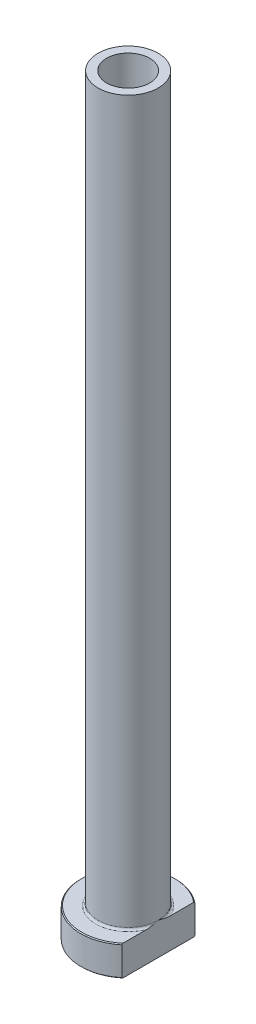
ISO-10303-21;
HEADER;
FILE_DESCRIPTION(('STEP AP214'),'2;1');
FILE_NAME('part.step','',(''),(''),'','','');
FILE_SCHEMA(('AUTOMOTIVE_DESIGN { 1 0 10303 214 1 1 1 1 }'));
ENDSEC;
DATA;
#1=APPLICATION_CONTEXT('core data for automotive mechanical design processes');
#2=APPLICATION_PROTOCOL_DEFINITION('international standard','automotive_design',2000,#1);
#3=PRODUCT_CONTEXT('',#1,'mechanical');
#4=PRODUCT('Part','Part','',(#3));
#5=PRODUCT_RELATED_PRODUCT_CATEGORY('part','',(#4));
#6=PRODUCT_DEFINITION_FORMATION('','',#4);
#7=PRODUCT_DEFINITION_CONTEXT('part definition',#1,'design');
#8=PRODUCT_DEFINITION('design','',#6,#7);
#9=PRODUCT_DEFINITION_SHAPE('','',#8);
#10=(LENGTH_UNIT() NAMED_UNIT(*) SI_UNIT(.MILLI.,.METRE.));
#11=(NAMED_UNIT(*) PLANE_ANGLE_UNIT() SI_UNIT($,.RADIAN.));
#12=(NAMED_UNIT(*) SI_UNIT($,.STERADIAN.) SOLID_ANGLE_UNIT());
#13=UNCERTAINTY_MEASURE_WITH_UNIT(LENGTH_MEASURE(1.E-05),#10,'distance_accuracy_value','');
#14=(GEOMETRIC_REPRESENTATION_CONTEXT(3) GLOBAL_UNCERTAINTY_ASSIGNED_CONTEXT((#13)) GLOBAL_UNIT_ASSIGNED_CONTEXT((#10,
#11,#12)) REPRESENTATION_CONTEXT('',''));
#15=CARTESIAN_POINT('',(0.,0.,0.));
#16=DIRECTION('',(0.,0.,1.));
#17=DIRECTION('',(1.,0.,0.));
#18=AXIS2_PLACEMENT_3D('',#15,#16,#17);
#19=CARTESIAN_POINT('',(0.,92.1876809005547,0.));
#20=DIRECTION('',(0.,1.,0.));
#21=DIRECTION('',(0.,0.,1.));
#22=AXIS2_PLACEMENT_3D('',#19,#20,#21);
#23=CYLINDRICAL_SURFACE('',#22,5.);
#24=CARTESIAN_POINT('',(0.,175.,0.));
#25=DIRECTION('',(0.,1.,0.));
#26=DIRECTION('',(0.,0.,1.));
#27=AXIS2_PLACEMENT_3D('',#24,#25,#26);
#28=CIRCLE('',#27,5.);
#29=CARTESIAN_POINT('',(0.,175.,5.));
#30=VERTEX_POINT('',#29);
#31=EDGE_CURVE('E167',#30,#30,#28,.T.);
#32=ORIENTED_EDGE('',*,*,#31,.T.);
#33=EDGE_LOOP('',(#32));
#34=FACE_BOUND('',#33,.T.);
#35=CARTESIAN_POINT('',(0.,130.,0.));
#36=DIRECTION('',(0.,1.,0.));
#37=DIRECTION('',(0.,0.,1.));
#38=AXIS2_PLACEMENT_3D('',#35,#36,#37);
#39=CIRCLE('',#38,5.);
#40=CARTESIAN_POINT('',(0.,130.,5.));
#41=VERTEX_POINT('',#40);
#42=EDGE_CURVE('E170',#41,#41,#39,.T.);
#43=ORIENTED_EDGE('',*,*,#42,.F.);
#44=EDGE_LOOP('',(#43));
#45=FACE_BOUND('',#44,.T.);
#46=ADVANCED_FACE('F32',(#34,#45),#23,.F.);
#47=CARTESIAN_POINT('',(-5.,175.,0.));
#48=DIRECTION('',(0.,1.,0.));
#49=DIRECTION('',(0.,0.,1.));
#50=AXIS2_PLACEMENT_3D('',#47,#48,#49);
#51=PLANE('',#50);
#52=CARTESIAN_POINT('',(0.,175.,0.));
#53=DIRECTION('',(0.,1.,0.));
#54=DIRECTION('',(0.,0.,1.));
#55=AXIS2_PLACEMENT_3D('',#52,#53,#54);
#56=CIRCLE('',#55,7.00000000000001);
#57=CARTESIAN_POINT('',(0.,175.,7.00000000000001));
#58=VERTEX_POINT('',#57);
#59=EDGE_CURVE('E174',#58,#58,#56,.T.);
#60=ORIENTED_EDGE('',*,*,#59,.T.);
#61=EDGE_LOOP('',(#60));
#62=FACE_BOUND('',#61,.T.);
#63=ORIENTED_EDGE('',*,*,#31,.F.);
#64=EDGE_LOOP('',(#63));
#65=FACE_BOUND('',#64,.T.);
#66=ADVANCED_FACE('F157',(#62,#65),#51,.T.);
#67=CARTESIAN_POINT('',(0.,92.1876809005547,0.));
#68=DIRECTION('',(0.,1.,0.));
#69=DIRECTION('',(0.,0.,1.));
#70=AXIS2_PLACEMENT_3D('',#67,#68,#69);
#71=CYLINDRICAL_SURFACE('',#70,7.);
#72=CARTESIAN_POINT('',(0.,7.50000000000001,0.));
#73=DIRECTION('',(0.,1.,0.));
#74=DIRECTION('',(0.,0.,1.));
#75=AXIS2_PLACEMENT_3D('',#72,#73,#74);
#76=CIRCLE('',#75,7.);
#77=CARTESIAN_POINT('',(7.,7.50000000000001,0.));
#78=VERTEX_POINT('',#77);
#79=EDGE_CURVE('E180',#78,#78,#76,.T.);
#80=ORIENTED_EDGE('',*,*,#79,.T.);
#81=EDGE_LOOP('',(#80));
#82=FACE_BOUND('',#81,.T.);
#83=ORIENTED_EDGE('',*,*,#59,.F.);
#84=EDGE_LOOP('',(#83));
#85=FACE_BOUND('',#84,.T.);
#86=ADVANCED_FACE('F162',(#82,#85),#71,.T.);
#87=CARTESIAN_POINT('',(-6.99999999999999,7.,0.));
#88=DIRECTION('',(0.,1.,0.));
#89=DIRECTION('',(0.,0.,1.));
#90=AXIS2_PLACEMENT_3D('',#87,#88,#89);
#91=PLANE('',#90);
#92=DIRECTION('',(0.,0.,1.));
#93=VECTOR('',#92,1.);
#94=CARTESIAN_POINT('',(6.99999999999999,7.,0.));
#95=LINE('',#94,#93);
#96=CARTESIAN_POINT('',(7.,7.,-8.22435407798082));
#97=VERTEX_POINT('',#96);
#98=CARTESIAN_POINT('',(6.99999999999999,7.,-2.69258240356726));
#99=VERTEX_POINT('',#98);
#100=EDGE_CURVE('E54',#97,#99,#95,.T.);
#101=ORIENTED_EDGE('',*,*,#100,.F.);
#102=CARTESIAN_POINT('',(0.,7.,0.));
#103=DIRECTION('',(0.,1.,0.));
#104=DIRECTION('',(0.,0.,1.));
#105=AXIS2_PLACEMENT_3D('',#102,#103,#104);
#106=CIRCLE('',#105,10.8);
#107=CARTESIAN_POINT('',(6.99999999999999,7.,8.22435407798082));
#108=VERTEX_POINT('',#107);
#109=EDGE_CURVE('E186',#97,#108,#106,.T.);
#110=ORIENTED_EDGE('',*,*,#109,.T.);
#111=CARTESIAN_POINT('',(6.99999999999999,7.,2.69258240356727));
#112=VERTEX_POINT('',#111);
#113=EDGE_CURVE('E134',#112,#108,#95,.T.);
#114=ORIENTED_EDGE('',*,*,#113,.F.);
#115=CARTESIAN_POINT('',(0.,7.,0.));
#116=DIRECTION('',(0.,1.,0.));
#117=DIRECTION('',(0.,0.,1.));
#118=AXIS2_PLACEMENT_3D('',#115,#116,#117);
#119=CIRCLE('',#118,7.5);
#120=EDGE_CURVE('E183',#112,#99,#119,.F.);
#121=ORIENTED_EDGE('',*,*,#120,.T.);
#122=EDGE_LOOP('',(#101,#110,#114,#121));
#123=FACE_BOUND('',#122,.T.);
#124=ADVANCED_FACE('F197',(#123),#91,.T.);
#125=CARTESIAN_POINT('',(0.,92.1876809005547,0.));
#126=DIRECTION('',(0.,1.,0.));
#127=DIRECTION('',(0.,0.,1.));
#128=AXIS2_PLACEMENT_3D('',#125,#126,#127);
#129=CYLINDRICAL_SURFACE('',#128,11.);
#130=DIRECTION('',(0.,-1.,0.));
#131=VECTOR('',#130,1.);
#132=CARTESIAN_POINT('',(6.99999999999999,175.,8.48528137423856));
#133=LINE('',#132,#131);
#134=CARTESIAN_POINT('',(6.99999999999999,6.8,8.48528137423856));
#135=VERTEX_POINT('',#134);
#136=CARTESIAN_POINT('',(6.99999999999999,0.199999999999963,8.48528137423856));
#137=VERTEX_POINT('',#136);
#138=EDGE_CURVE('E82',#135,#137,#133,.T.);
#139=ORIENTED_EDGE('',*,*,#138,.F.);
#140=CARTESIAN_POINT('',(0.,6.8,0.));
#141=DIRECTION('',(0.,1.,0.));
#142=DIRECTION('',(0.,0.,1.));
#143=AXIS2_PLACEMENT_3D('',#140,#141,#142);
#144=CIRCLE('',#143,11.);
#145=CARTESIAN_POINT('',(7.,6.8,-8.48528137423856));
#146=VERTEX_POINT('',#145);
#147=EDGE_CURVE('E95',#135,#146,#144,.F.);
#148=ORIENTED_EDGE('',*,*,#147,.T.);
#149=DIRECTION('',(0.,-1.,0.));
#150=VECTOR('',#149,1.);
#151=CARTESIAN_POINT('',(7.,175.,-8.48528137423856));
#152=LINE('',#151,#150);
#153=CARTESIAN_POINT('',(7.,0.199999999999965,-8.48528137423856));
#154=VERTEX_POINT('',#153);
#155=EDGE_CURVE('E192',#146,#154,#152,.T.);
#156=ORIENTED_EDGE('',*,*,#155,.T.);
#157=CARTESIAN_POINT('',(0.,0.199999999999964,0.));
#158=DIRECTION('',(0.,-1.,0.));
#159=DIRECTION('',(0.,0.,-1.));
#160=AXIS2_PLACEMENT_3D('',#157,#158,#159);
#161=CIRCLE('',#160,11.);
#162=EDGE_CURVE('E98',#154,#137,#161,.F.);
#163=ORIENTED_EDGE('',*,*,#162,.T.);
#164=EDGE_LOOP('',(#139,#148,#156,#163));
#165=FACE_BOUND('',#164,.T.);
#166=ADVANCED_FACE('F190',(#165),#129,.T.);
#167=CARTESIAN_POINT('',(-11.,0.,0.));
#168=DIRECTION('',(0.,-1.,0.));
#169=DIRECTION('',(0.,0.,-1.));
#170=AXIS2_PLACEMENT_3D('',#167,#168,#169);
#171=PLANE('',#170);
#172=CARTESIAN_POINT('',(0.,0.,0.));
#173=DIRECTION('',(0.,-1.,0.));
#174=DIRECTION('',(0.,0.,-1.));
#175=AXIS2_PLACEMENT_3D('',#172,#173,#174);
#176=CIRCLE('',#175,5.74999999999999);
#177=CARTESIAN_POINT('',(0.,0.,-5.74999999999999));
#178=VERTEX_POINT('',#177);
#179=EDGE_CURVE('E40',#178,#178,#176,.F.);
#180=ORIENTED_EDGE('',*,*,#179,.T.);
#181=EDGE_LOOP('',(#180));
#182=FACE_BOUND('',#181,.T.);
#183=DIRECTION('',(0.,0.,-1.));
#184=VECTOR('',#183,1.);
#185=CARTESIAN_POINT('',(6.99999999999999,0.,8.48528137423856));
#186=LINE('',#185,#184);
#187=CARTESIAN_POINT('',(6.99999999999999,0.,8.22435407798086));
#188=VERTEX_POINT('',#187);
#189=CARTESIAN_POINT('',(7.,0.,-8.22435407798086));
#190=VERTEX_POINT('',#189);
#191=EDGE_CURVE('E47',#188,#190,#186,.T.);
#192=ORIENTED_EDGE('',*,*,#191,.F.);
#193=CARTESIAN_POINT('',(0.,0.,0.));
#194=DIRECTION('',(0.,-1.,0.));
#195=DIRECTION('',(0.,0.,-1.));
#196=AXIS2_PLACEMENT_3D('',#193,#194,#195);
#197=CIRCLE('',#196,10.8);
#198=EDGE_CURVE('E92',#188,#190,#197,.T.);
#199=ORIENTED_EDGE('',*,*,#198,.T.);
#200=EDGE_LOOP('',(#192,#199));
#201=FACE_BOUND('',#200,.T.);
#202=ADVANCED_FACE('F91',(#182,#201),#171,.T.);
#203=CARTESIAN_POINT('',(0.,92.1876809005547,0.));
#204=DIRECTION('',(0.,1.,0.));
#205=DIRECTION('',(0.,0.,1.));
#206=AXIS2_PLACEMENT_3D('',#203,#204,#205);
#207=CYLINDRICAL_SURFACE('',#206,5.25);
#208=CARTESIAN_POINT('',(0.,0.499999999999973,0.));
#209=DIRECTION('',(0.,-1.,0.));
#210=DIRECTION('',(0.,0.,-1.));
#211=AXIS2_PLACEMENT_3D('',#208,#209,#210);
#212=CIRCLE('',#211,5.25);
#213=CARTESIAN_POINT('',(0.,0.499999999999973,-5.25));
#214=VERTEX_POINT('',#213);
#215=EDGE_CURVE('E11',#214,#214,#212,.T.);
#216=ORIENTED_EDGE('',*,*,#215,.T.);
#217=EDGE_LOOP('',(#216));
#218=FACE_BOUND('',#217,.T.);
#219=CARTESIAN_POINT('',(0.,118.,0.));
#220=DIRECTION('',(0.,1.,0.));
#221=DIRECTION('',(0.,0.,1.));
#222=AXIS2_PLACEMENT_3D('',#219,#220,#221);
#223=CIRCLE('',#222,5.25000000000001);
#224=CARTESIAN_POINT('',(0.,118.,5.25000000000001));
#225=VERTEX_POINT('',#224);
#226=EDGE_CURVE('E172',#225,#225,#223,.T.);
#227=ORIENTED_EDGE('',*,*,#226,.T.);
#228=EDGE_LOOP('',(#227));
#229=FACE_BOUND('',#228,.T.);
#230=ADVANCED_FACE('F215',(#218,#229),#207,.F.);
#231=CARTESIAN_POINT('',(0.,118.,0.));
#232=DIRECTION('',(0.,-1.,0.));
#233=DIRECTION('',(0.,0.,-1.));
#234=AXIS2_PLACEMENT_3D('',#231,#232,#233);
#235=CONICAL_SURFACE('',#234,5.25000000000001,0.0208303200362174);
#236=ORIENTED_EDGE('',*,*,#42,.T.);
#237=EDGE_LOOP('',(#236));
#238=FACE_BOUND('',#237,.T.);
#239=ORIENTED_EDGE('',*,*,#226,.F.);
#240=EDGE_LOOP('',(#239));
#241=FACE_BOUND('',#240,.T.);
#242=ADVANCED_FACE('F111',(#238,#241),#235,.F.);
#243=CARTESIAN_POINT('',(0.,7.50000000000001,0.));
#244=DIRECTION('',(0.,1.,0.));
#245=DIRECTION('',(0.,0.,1.));
#246=AXIS2_PLACEMENT_3D('',#243,#244,#245);
#247=TOROIDAL_SURFACE('',#246,7.5,0.5);
#248=ORIENTED_EDGE('',*,*,#120,.F.);
#249=CARTESIAN_POINT('',(7.,7.50000000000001,0.));
#250=CARTESIAN_POINT('',(7.,7.50000080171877,-1.25568479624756E-10));
#251=CARTESIAN_POINT('',(7.,7.50000160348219,2.9022028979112E-07));
#252=CARTESIAN_POINT('',(7.,7.50000310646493,1.10846445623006E-06));
#253=CARTESIAN_POINT('',(7.,7.50000379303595,1.65470117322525E-06));
#254=CARTESIAN_POINT('',(7.,7.50000521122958,2.96102760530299E-06));
#255=CARTESIAN_POINT('',(7.,7.50000592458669,3.74204187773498E-06));
#256=CARTESIAN_POINT('',(7.,7.50000721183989,5.36891885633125E-06));
#257=CARTESIAN_POINT('',(7.,7.50000778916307,6.21226355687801E-06));
#258=CARTESIAN_POINT('',(7.,7.50000990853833,9.44889721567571E-06));
#259=CARTESIAN_POINT('',(7.,7.50001133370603,1.19224915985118E-05));
#260=CARTESIAN_POINT('',(7.,7.50001370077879,1.68453050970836E-05));
#261=CARTESIAN_POINT('',(7.,7.50001467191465,1.92810864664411E-05));
#262=CARTESIAN_POINT('',(7.,7.5000187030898,2.95057529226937E-05));
#263=CARTESIAN_POINT('',(7.,7.50002167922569,3.73333827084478E-05));
#264=CARTESIAN_POINT('',(7.,7.5000261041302,5.21820419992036E-05));
#265=CARTESIAN_POINT('',(7.,7.50002771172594,5.91556020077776E-05));
#266=CARTESIAN_POINT('',(7.,7.50003935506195,0.000110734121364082));
#267=CARTESIAN_POINT('',(7.,7.50004810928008,0.000155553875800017));
#268=CARTESIAN_POINT('',(6.99999999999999,7.50008643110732,0.00033254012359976));
#269=CARTESIAN_POINT('',(6.99999999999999,7.50012307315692,0.000463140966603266));
#270=CARTESIAN_POINT('',(7.,7.50026565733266,0.000980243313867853));
#271=CARTESIAN_POINT('',(7.,7.50036696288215,0.00136762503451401));
#272=CARTESIAN_POINT('',(6.99999999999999,7.50077257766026,0.00290683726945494));
#273=CARTESIAN_POINT('',(6.99999999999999,7.5010826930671,0.00405753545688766));
#274=CARTESIAN_POINT('',(7.,7.50237341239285,0.00885983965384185));
#275=CARTESIAN_POINT('',(7.,7.50334676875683,0.0125128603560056));
#276=CARTESIAN_POINT('',(6.99999999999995,7.51627189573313,0.0610038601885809));
#277=CARTESIAN_POINT('',(6.99999999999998,7.52827280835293,0.105832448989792));
#278=CARTESIAN_POINT('',(7.00000000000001,7.551709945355,0.193693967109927));
#279=CARTESIAN_POINT('',(7.,7.56314936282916,0.236726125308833));
#280=CARTESIAN_POINT('',(6.99999999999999,7.58740418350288,0.328321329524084));
#281=CARTESIAN_POINT('',(6.99999999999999,7.60020832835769,0.376887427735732));
#282=CARTESIAN_POINT('',(7.,7.62578161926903,0.474605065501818));
#283=CARTESIAN_POINT('',(7.,7.63854879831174,0.523757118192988));
#284=CARTESIAN_POINT('',(6.99999999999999,7.66904753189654,0.642366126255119));
#285=CARTESIAN_POINT('',(7.,7.68665961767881,0.711854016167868));
#286=CARTESIAN_POINT('',(7.,7.72074501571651,0.849103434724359));
#287=CARTESIAN_POINT('',(7.,7.73723627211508,0.916860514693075));
#288=CARTESIAN_POINT('',(7.,7.79038156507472,1.1410421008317));
#289=CARTESIAN_POINT('',(7.,7.82528973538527,1.29788860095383));
#290=CARTESIAN_POINT('',(7.,7.88862298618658,1.61471917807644));
#291=CARTESIAN_POINT('',(7.,7.91697354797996,1.77471883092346));
#292=CARTESIAN_POINT('',(7.,7.95258292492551,2.02253505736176));
#293=CARTESIAN_POINT('',(7.,7.96355251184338,2.10981398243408));
#294=CARTESIAN_POINT('',(7.,7.98165287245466,2.28476193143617));
#295=CARTESIAN_POINT('',(7.,7.98878459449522,2.37243085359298));
#296=CARTESIAN_POINT('',(7.,7.99822919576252,2.54760327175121));
#297=CARTESIAN_POINT('',(7.,8.00056589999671,2.63510541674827));
#298=CARTESIAN_POINT('',(7.,7.99919996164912,2.81004074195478));
#299=CARTESIAN_POINT('',(7.,7.99550272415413,2.89747391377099));
#300=CARTESIAN_POINT('',(7.,7.98391011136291,3.02882076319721));
#301=CARTESIAN_POINT('',(7.,7.9789723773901,3.0729968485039));
#302=CARTESIAN_POINT('',(7.,7.96665453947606,3.16105400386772));
#303=CARTESIAN_POINT('',(7.,7.9592724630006,3.20493480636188));
#304=CARTESIAN_POINT('',(7.,7.94168688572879,3.29163191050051));
#305=CARTESIAN_POINT('',(7.,7.93151559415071,3.3344546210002));
#306=CARTESIAN_POINT('',(7.,7.90768392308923,3.41909658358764));
#307=CARTESIAN_POINT('',(7.,7.89402748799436,3.46091691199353));
#308=CARTESIAN_POINT('',(7.,7.86214701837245,3.54331777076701));
#309=CARTESIAN_POINT('',(7.,7.84387618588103,3.58388050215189));
#310=CARTESIAN_POINT('',(7.,7.80145892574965,3.66184445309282));
#311=CARTESIAN_POINT('',(7.,7.77733569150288,3.69925738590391));
#312=CARTESIAN_POINT('',(7.,7.73714014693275,3.74836513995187));
#313=CARTESIAN_POINT('',(7.,7.72423208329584,3.76263695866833));
#314=CARTESIAN_POINT('',(7.,7.69673765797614,3.78951670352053));
#315=CARTESIAN_POINT('',(7.,7.68215013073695,3.80212346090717));
#316=CARTESIAN_POINT('',(7.,7.65099843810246,3.82514624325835));
#317=CARTESIAN_POINT('',(7.,7.63441049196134,3.83553078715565));
#318=CARTESIAN_POINT('',(7.,7.59955798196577,3.8529401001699));
#319=CARTESIAN_POINT('',(7.,7.58129885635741,3.85997533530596));
#320=CARTESIAN_POINT('',(7.,7.54906837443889,3.86837810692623));
#321=CARTESIAN_POINT('',(7.,7.53536870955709,3.87079233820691));
#322=CARTESIAN_POINT('',(7.,7.50775756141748,3.87325240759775));
#323=CARTESIAN_POINT('',(7.,7.4938461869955,3.87329942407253));
#324=CARTESIAN_POINT('',(7.,7.46623771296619,3.87102093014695));
#325=CARTESIAN_POINT('',(7.,7.45254041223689,3.8686978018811));
#326=CARTESIAN_POINT('',(7.,7.42569741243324,3.86188775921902));
#327=CARTESIAN_POINT('',(7.,7.41255212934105,3.85739924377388));
#328=CARTESIAN_POINT('',(7.,7.3825931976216,3.84468786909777));
#329=CARTESIAN_POINT('',(7.,7.36610215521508,3.83570823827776));
#330=CARTESIAN_POINT('',(7.,7.33476729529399,3.81523202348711));
#331=CARTESIAN_POINT('',(7.,7.31992737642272,3.80372966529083));
#332=CARTESIAN_POINT('',(7.,7.28371925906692,3.77170797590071));
#333=CARTESIAN_POINT('',(7.,7.26356272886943,3.74983059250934));
#334=CARTESIAN_POINT('',(7.,7.22671696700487,3.70338283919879));
#335=CARTESIAN_POINT('',(7.,7.2100336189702,3.67880800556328));
#336=CARTESIAN_POINT('',(7.,7.18026553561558,3.62921731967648));
#337=CARTESIAN_POINT('',(7.,7.16704475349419,3.60428175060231));
#338=CARTESIAN_POINT('',(7.,7.14275069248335,3.55337478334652));
#339=CARTESIAN_POINT('',(7.,7.1316794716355,3.52740242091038));
#340=CARTESIAN_POINT('',(7.,7.10104499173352,3.44809573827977));
#341=CARTESIAN_POINT('',(7.,7.08424174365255,3.39369851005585));
#342=CARTESIAN_POINT('',(7.,7.05431378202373,3.27667221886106));
#343=CARTESIAN_POINT('',(7.,7.04191718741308,3.21386807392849));
#344=CARTESIAN_POINT('',(7.,7.02234605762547,3.08735184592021));
#345=CARTESIAN_POINT('',(7.,7.01518234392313,3.0236381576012));
#346=CARTESIAN_POINT('',(7.,7.00517826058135,2.8977900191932));
#347=CARTESIAN_POINT('',(7.,7.00221627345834,2.8356646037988));
#348=CARTESIAN_POINT('',(7.,6.99952325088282,2.71160626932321));
#349=CARTESIAN_POINT('',(7.,6.99977918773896,2.64967358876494));
#350=CARTESIAN_POINT('',(7.,7.00377761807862,2.49407814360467));
#351=CARTESIAN_POINT('',(7.,7.00924384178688,2.40046113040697));
#352=CARTESIAN_POINT('',(7.,7.02494106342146,2.21367396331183));
#353=CARTESIAN_POINT('',(7.,7.0351710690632,2.12050372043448));
#354=CARTESIAN_POINT('',(7.,7.05969765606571,1.93249035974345));
#355=CARTESIAN_POINT('',(7.,7.07408383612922,1.83765914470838));
#356=CARTESIAN_POINT('',(7.,7.1060330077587,1.6482934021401));
#357=CARTESIAN_POINT('',(7.,7.12360402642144,1.55376025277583));
#358=CARTESIAN_POINT('',(7.,7.16806468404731,1.33086107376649));
#359=CARTESIAN_POINT('',(7.,7.19601783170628,1.20270896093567));
#360=CARTESIAN_POINT('',(7.,7.25475947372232,0.948586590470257));
#361=CARTESIAN_POINT('',(7.,7.28551257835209,0.822607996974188));
#362=CARTESIAN_POINT('',(7.,7.33123897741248,0.64133402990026));
#363=CARTESIAN_POINT('',(7.,7.34543722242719,0.585840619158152));
#364=CARTESIAN_POINT('',(6.99999999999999,7.37418243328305,0.474686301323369));
#365=CARTESIAN_POINT('',(6.99999999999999,7.38873064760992,0.419025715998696));
#366=CARTESIAN_POINT('',(7.,7.41873357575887,0.305011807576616));
#367=CARTESIAN_POINT('',(7.,7.43419762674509,0.246660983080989));
#368=CARTESIAN_POINT('',(6.99999999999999,7.46502361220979,0.130933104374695));
#369=CARTESIAN_POINT('',(6.99999999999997,7.48038319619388,0.073555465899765));
#370=CARTESIAN_POINT('',(7.,7.49665455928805,0.0125077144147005));
#371=CARTESIAN_POINT('',(7.,7.49762931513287,0.00884956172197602));
#372=CARTESIAN_POINT('',(6.99999999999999,7.49892036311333,0.00404608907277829));
#373=CARTESIAN_POINT('',(6.99999999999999,7.49922940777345,0.00289935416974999));
#374=CARTESIAN_POINT('',(7.,7.49963371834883,0.00136508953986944));
#375=CARTESIAN_POINT('',(7.,7.49973476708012,0.000978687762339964));
#376=CARTESIAN_POINT('',(6.99999999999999,7.49987704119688,0.00046273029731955));
#377=CARTESIAN_POINT('',(6.99999999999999,7.4999136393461,0.000332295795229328));
#378=CARTESIAN_POINT('',(7.,7.49995192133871,0.000155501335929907));
#379=CARTESIAN_POINT('',(7.,7.49996067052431,0.000110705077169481));
#380=CARTESIAN_POINT('',(7.,7.49997230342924,5.91504871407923E-05));
#381=CARTESIAN_POINT('',(7.,7.49997390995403,5.21782476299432E-05));
#382=CARTESIAN_POINT('',(7.,7.49997833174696,3.73322821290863E-05));
#383=CARTESIAN_POINT('',(7.,7.49998130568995,2.95059555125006E-05));
#384=CARTESIAN_POINT('',(7.,7.49998533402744,1.92826357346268E-05));
#385=CARTESIAN_POINT('',(7.,7.49998630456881,1.68469531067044E-05));
#386=CARTESIAN_POINT('',(7.,7.49998867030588,1.19242379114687E-05));
#387=CARTESIAN_POINT('',(7.,7.49999009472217,9.45063101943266E-06));
#388=CARTESIAN_POINT('',(7.,7.49999221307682,6.21386478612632E-06));
#389=CARTESIAN_POINT('',(7.,7.4999927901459,5.37045339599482E-06));
#390=CARTESIAN_POINT('',(7.,7.49999407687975,3.74339717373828E-06));
#391=CARTESIAN_POINT('',(7.,7.49999478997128,2.96226879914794E-06));
#392=CARTESIAN_POINT('',(7.,7.49999620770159,1.65567359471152E-06));
#393=CARTESIAN_POINT('',(7.,7.49999689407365,1.10929204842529E-06));
#394=CARTESIAN_POINT('',(7.,7.49999839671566,2.90683225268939E-07));
#395=CARTESIAN_POINT('',(7.,7.49999919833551,1.25561410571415E-10));
#396=CARTESIAN_POINT('',(7.,7.50000000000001,0.));
#397=B_SPLINE_CURVE_WITH_KNOTS('',3,(#249,#250,#251,#252,#253,#254,#255,#256,#257,#258,#259,
#260,#261,#262,#263,#264,#265,#266,#267,#268,#269,#270,#271,#272,#273,#274,#275,#276,#277,#278,
#279,#280,#281,#282,#283,#284,#285,#286,#287,#288,#289,#290,#291,#292,#293,#294,#295,#296,#297,
#298,#299,#300,#301,#302,#303,#304,#305,#306,#307,#308,#309,#310,#311,#312,#313,#314,#315,#316,
#317,#318,#319,#320,#321,#322,#323,#324,#325,#326,#327,#328,#329,#330,#331,#332,#333,#334,#335,
#336,#337,#338,#339,#340,#341,#342,#343,#344,#345,#346,#347,#348,#349,#350,#351,#352,#353,#354,
#355,#356,#357,#358,#359,#360,#361,#362,#363,#364,#365,#366,#367,#368,#369,#370,#371,#372,#373,
#374,#375,#376,#377,#378,#379,#380,#381,#382,#383,#384,#385,#386,#387,#388,#389,#390,#391,#392,
#393,#394,#395,#396),.UNSPECIFIED.,.T.,.F.,(4,2,2,2,2,2,2,2,2,2,2,2,2,2,2,2,2,2,2,2,2,2,2,2,2,2,
2,2,2,2,2,2,2,2,2,2,2,2,2,2,2,2,2,2,2,2,2,2,2,2,2,2,2,2,2,2,2,2,2,2,2,2,2,2,2,2,2,2,2,2,2,2,2,
4),(0.,2.42201381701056E-06,5.0530479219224E-06,8.20814016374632E-06,1.12722920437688E-05,
1.98044004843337E-05,2.76642048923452E-05,5.27403832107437E-05,7.41830767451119E-05,
0.000211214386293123,0.000617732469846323,0.00181938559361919,0.00539412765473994,
0.016736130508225,0.155952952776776,0.2895341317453,0.440210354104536,0.592559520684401,
0.807611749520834,1.0168149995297,1.49878389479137,1.98598665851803,2.24981935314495,
2.5135868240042,2.77604050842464,3.03825922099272,3.17156039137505,3.3049693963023,
3.43689837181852,3.5686786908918,3.70185328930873,3.83450849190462,3.89212877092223,
3.94978928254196,4.00821928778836,4.06646549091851,4.10801107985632,4.14953598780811,
4.19101920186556,4.23253313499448,4.28854866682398,4.34469377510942,4.4334341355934,
4.52232362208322,4.60686785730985,4.69149264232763,4.86185145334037,5.05362927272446,
5.24580256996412,5.43229132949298,5.61802533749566,5.89918385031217,6.18028382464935,
6.46796485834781,6.75638131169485,7.14981284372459,7.53882346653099,7.71066604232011,
7.88325629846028,8.0643532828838,8.24254095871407,8.25389891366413,8.25746134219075,
8.25865995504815,8.25906595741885,8.25920291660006,8.25922435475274,8.25924942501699,
8.25925728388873,8.25926581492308,8.25926887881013,8.25927203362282,8.25927466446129,
8.25927708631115),.UNSPECIFIED.);
#398=EDGE_CURVE('E126',#112,#78,#397,.T.);
#399=ORIENTED_EDGE('',*,*,#398,.T.);
#400=ORIENTED_EDGE('',*,*,#79,.F.);
#401=CARTESIAN_POINT('',(7.,7.50000000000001,0.));
#402=CARTESIAN_POINT('',(7.,7.49999919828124,1.25569885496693E-10));
#403=CARTESIAN_POINT('',(7.,7.49999839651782,-2.90220288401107E-07));
#404=CARTESIAN_POINT('',(7.,7.49999689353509,-1.10846445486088E-06));
#405=CARTESIAN_POINT('',(7.,7.49999620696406,-1.65470117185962E-06));
#406=CARTESIAN_POINT('',(7.,7.49999478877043,-2.96102760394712E-06));
#407=CARTESIAN_POINT('',(7.,7.49999407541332,-3.7420418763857E-06));
#408=CARTESIAN_POINT('',(7.,7.49999278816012,-5.36891885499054E-06));
#409=CARTESIAN_POINT('',(7.,7.49999221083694,-6.2122635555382E-06));
#410=CARTESIAN_POINT('',(7.,7.49999009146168,-9.44889721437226E-06));
#411=CARTESIAN_POINT('',(7.,7.49998866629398,-1.19224915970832E-05));
#412=CARTESIAN_POINT('',(7.,7.49998629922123,-1.68453050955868E-05));
#413=CARTESIAN_POINT('',(7.,7.49998532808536,-1.92810864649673E-05));
#414=CARTESIAN_POINT('',(7.,7.49998129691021,-2.950575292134E-05));
#415=CARTESIAN_POINT('',(7.,7.49997832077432,-3.73333827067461E-05));
#416=CARTESIAN_POINT('',(7.,7.49997389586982,-5.21820419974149E-05));
#417=CARTESIAN_POINT('',(7.,7.49997228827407,-5.91556020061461E-05));
#418=CARTESIAN_POINT('',(7.,7.49996064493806,-0.000110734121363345));
#419=CARTESIAN_POINT('',(7.,7.49995189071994,-0.000155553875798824));
#420=CARTESIAN_POINT('',(6.99999999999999,7.49991356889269,-0.000332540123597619));
#421=CARTESIAN_POINT('',(6.99999999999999,7.49987692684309,-0.00046314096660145));
#422=CARTESIAN_POINT('',(7.,7.49973434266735,-0.000980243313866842));
#423=CARTESIAN_POINT('',(7.,7.49963303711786,-0.00136762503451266));
#424=CARTESIAN_POINT('',(6.99999999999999,7.49922742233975,-0.0029068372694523));
#425=CARTESIAN_POINT('',(6.99999999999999,7.49891730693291,-0.00405753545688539));
#426=CARTESIAN_POINT('',(7.,7.49762658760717,-0.00885983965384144));
#427=CARTESIAN_POINT('',(7.,7.49665323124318,-0.0125128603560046));
#428=CARTESIAN_POINT('',(6.99999999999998,7.48372810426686,-0.0610038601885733));
#429=CARTESIAN_POINT('',(6.99999999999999,7.47172719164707,-0.105832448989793));
#430=CARTESIAN_POINT('',(7.,7.44829005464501,-0.193693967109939));
#431=CARTESIAN_POINT('',(7.,7.43685063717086,-0.236726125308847));
#432=CARTESIAN_POINT('',(6.99999999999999,7.41259581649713,-0.328321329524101));
#433=CARTESIAN_POINT('',(7.,7.39979167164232,-0.376887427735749));
#434=CARTESIAN_POINT('',(7.,7.37421838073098,-0.474605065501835));
#435=CARTESIAN_POINT('',(7.,7.36145120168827,-0.523757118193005));
#436=CARTESIAN_POINT('',(7.,7.33095246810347,-0.642366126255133));
#437=CARTESIAN_POINT('',(7.,7.3133403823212,-0.711854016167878));
#438=CARTESIAN_POINT('',(7.,7.2792549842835,-0.849103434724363));
#439=CARTESIAN_POINT('',(7.,7.26276372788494,-0.916860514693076));
#440=CARTESIAN_POINT('',(7.,7.20961843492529,-1.1410421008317));
#441=CARTESIAN_POINT('',(7.,7.17471026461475,-1.29788860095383));
#442=CARTESIAN_POINT('',(7.,7.11137701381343,-1.61471917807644));
#443=CARTESIAN_POINT('',(7.,7.08302645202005,-1.77471883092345));
#444=CARTESIAN_POINT('',(7.,7.0474170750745,-2.02253505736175));
#445=CARTESIAN_POINT('',(7.,7.03644748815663,-2.10981398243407));
#446=CARTESIAN_POINT('',(7.,7.01834712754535,-2.28476193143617));
#447=CARTESIAN_POINT('',(7.,7.01121540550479,-2.37243085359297));
#448=CARTESIAN_POINT('',(7.,7.00177080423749,-2.5476032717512));
#449=CARTESIAN_POINT('',(7.,6.9994341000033,-2.63510541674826));
#450=CARTESIAN_POINT('',(7.,7.00080003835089,-2.81004074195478));
#451=CARTESIAN_POINT('',(7.,7.00449727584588,-2.89747391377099));
#452=CARTESIAN_POINT('',(7.,7.01608988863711,-3.02882076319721));
#453=CARTESIAN_POINT('',(7.,7.02102762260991,-3.0729968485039));
#454=CARTESIAN_POINT('',(7.,7.03334546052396,-3.16105400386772));
#455=CARTESIAN_POINT('',(7.,7.04072753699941,-3.20493480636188));
#456=CARTESIAN_POINT('',(7.,7.05831311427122,-3.29163191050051));
#457=CARTESIAN_POINT('',(7.,7.06848440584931,-3.3344546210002));
#458=CARTESIAN_POINT('',(7.,7.09231607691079,-3.41909658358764));
#459=CARTESIAN_POINT('',(7.,7.10597251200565,-3.46091691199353));
#460=CARTESIAN_POINT('',(7.,7.13785298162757,-3.54331777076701));
#461=CARTESIAN_POINT('',(7.,7.15612381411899,-3.58388050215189));
#462=CARTESIAN_POINT('',(7.,7.19854107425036,-3.66184445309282));
#463=CARTESIAN_POINT('',(7.,7.22266430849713,-3.69925738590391));
#464=CARTESIAN_POINT('',(7.,7.26285985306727,-3.74836513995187));
#465=CARTESIAN_POINT('',(7.,7.27576791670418,-3.76263695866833));
#466=CARTESIAN_POINT('',(7.,7.30326234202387,-3.78951670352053));
#467=CARTESIAN_POINT('',(7.,7.31784986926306,-3.80212346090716));
#468=CARTESIAN_POINT('',(7.,7.34900156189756,-3.82514624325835));
#469=CARTESIAN_POINT('',(7.,7.36558950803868,-3.83553078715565));
#470=CARTESIAN_POINT('',(7.,7.40044201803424,-3.8529401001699));
#471=CARTESIAN_POINT('',(7.,7.4187011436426,-3.85997533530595));
#472=CARTESIAN_POINT('',(7.,7.45093162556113,-3.86837810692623));
#473=CARTESIAN_POINT('',(7.,7.46463129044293,-3.87079233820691));
#474=CARTESIAN_POINT('',(7.,7.49224243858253,-3.87325240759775));
#475=CARTESIAN_POINT('',(7.,7.50615381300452,-3.87329942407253));
#476=CARTESIAN_POINT('',(7.,7.53376228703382,-3.87102093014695));
#477=CARTESIAN_POINT('',(7.,7.54745958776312,-3.8686978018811));
#478=CARTESIAN_POINT('',(7.,7.57430258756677,-3.86188775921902));
#479=CARTESIAN_POINT('',(7.,7.58744787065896,-3.85739924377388));
#480=CARTESIAN_POINT('',(7.,7.61740680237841,-3.84468786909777));
#481=CARTESIAN_POINT('',(7.,7.63389784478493,-3.83570823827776));
#482=CARTESIAN_POINT('',(7.,7.66523270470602,-3.81523202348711));
#483=CARTESIAN_POINT('',(7.,7.68007262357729,-3.80372966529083));
#484=CARTESIAN_POINT('',(7.,7.71628074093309,-3.77170797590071));
#485=CARTESIAN_POINT('',(7.,7.73643727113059,-3.74983059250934));
#486=CARTESIAN_POINT('',(7.,7.77328303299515,-3.70338283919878));
#487=CARTESIAN_POINT('',(7.,7.78996638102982,-3.67880800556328));
#488=CARTESIAN_POINT('',(7.,7.81973446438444,-3.62921731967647));
#489=CARTESIAN_POINT('',(7.,7.83295524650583,-3.6042817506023));
#490=CARTESIAN_POINT('',(7.,7.85724930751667,-3.55337478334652));
#491=CARTESIAN_POINT('',(7.,7.86832052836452,-3.52740242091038));
#492=CARTESIAN_POINT('',(7.,7.89895500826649,-3.44809573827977));
#493=CARTESIAN_POINT('',(7.,7.91575825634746,-3.39369851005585));
#494=CARTESIAN_POINT('',(7.,7.94568621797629,-3.27667221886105));
#495=CARTESIAN_POINT('',(7.,7.95808281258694,-3.21386807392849));
#496=CARTESIAN_POINT('',(7.,7.97765394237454,-3.0873518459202));
#497=CARTESIAN_POINT('',(7.,7.98481765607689,-3.02363815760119));
#498=CARTESIAN_POINT('',(7.,7.99482173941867,-2.89779001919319));
#499=CARTESIAN_POINT('',(7.,7.99778372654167,-2.83566460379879));
#500=CARTESIAN_POINT('',(7.,8.0004767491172,-2.71160626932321));
#501=CARTESIAN_POINT('',(7.,8.00022081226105,-2.64967358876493));
#502=CARTESIAN_POINT('',(7.,7.99622238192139,-2.49407814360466));
#503=CARTESIAN_POINT('',(7.,7.99075615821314,-2.40046113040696));
#504=CARTESIAN_POINT('',(7.,7.97505893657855,-2.21367396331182));
#505=CARTESIAN_POINT('',(7.,7.96482893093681,-2.12050372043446));
#506=CARTESIAN_POINT('',(7.,7.9403023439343,-1.93249035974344));
#507=CARTESIAN_POINT('',(7.,7.92591616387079,-1.83765914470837));
#508=CARTESIAN_POINT('',(7.,7.89396699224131,-1.64829340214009));
#509=CARTESIAN_POINT('',(7.,7.87639597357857,-1.55376025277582));
#510=CARTESIAN_POINT('',(7.,7.8319353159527,-1.33086107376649));
#511=CARTESIAN_POINT('',(7.,7.80398216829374,-1.20270896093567));
#512=CARTESIAN_POINT('',(7.,7.7452405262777,-0.948586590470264));
#513=CARTESIAN_POINT('',(7.,7.71448742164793,-0.822607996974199));
#514=CARTESIAN_POINT('',(7.,7.66876102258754,-0.641334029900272));
#515=CARTESIAN_POINT('',(7.,7.65456277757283,-0.585840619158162));
#516=CARTESIAN_POINT('',(6.99999999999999,7.62581756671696,-0.474686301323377));
#517=CARTESIAN_POINT('',(6.99999999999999,7.61126935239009,-0.419025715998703));
#518=CARTESIAN_POINT('',(7.,7.58126642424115,-0.305011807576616));
#519=CARTESIAN_POINT('',(7.,7.56580237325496,-0.246660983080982));
#520=CARTESIAN_POINT('',(6.99999999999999,7.53497638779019,-0.130933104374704));
#521=CARTESIAN_POINT('',(6.99999999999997,7.519616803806,-0.0735554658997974));
#522=CARTESIAN_POINT('',(7.,7.50334544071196,-0.0125077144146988));
#523=CARTESIAN_POINT('',(7.,7.50237068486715,-0.00884956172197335));
#524=CARTESIAN_POINT('',(6.99999999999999,7.50107963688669,-0.00404608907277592));
#525=CARTESIAN_POINT('',(6.99999999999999,7.50077059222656,-0.00289935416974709));
#526=CARTESIAN_POINT('',(7.,7.50036628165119,-0.00136508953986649));
#527=CARTESIAN_POINT('',(7.,7.50026523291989,-0.000978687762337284));
#528=CARTESIAN_POINT('',(6.99999999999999,7.50012295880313,-0.000462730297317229));
#529=CARTESIAN_POINT('',(6.99999999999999,7.50008636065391,-0.000332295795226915));
#530=CARTESIAN_POINT('',(7.,7.50004807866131,-0.000155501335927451));
#531=CARTESIAN_POINT('',(7.,7.50003932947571,-0.000110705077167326));
#532=CARTESIAN_POINT('',(7.,7.50002769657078,-5.91504871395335E-05));
#533=CARTESIAN_POINT('',(7.,7.50002609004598,-5.21782476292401E-05));
#534=CARTESIAN_POINT('',(7.,7.50002166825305,-3.73322821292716E-05));
#535=CARTESIAN_POINT('',(7.,7.50001869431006,-2.95059555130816E-05));
#536=CARTESIAN_POINT('',(7.,7.50001466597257,-1.9282635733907E-05));
#537=CARTESIAN_POINT('',(7.,7.5000136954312,-1.68469531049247E-05));
#538=CARTESIAN_POINT('',(7.,7.50001132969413,-1.19242379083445E-05));
#539=CARTESIAN_POINT('',(7.,7.50000990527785,-9.45063101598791E-06));
#540=CARTESIAN_POINT('',(7.,7.50000778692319,-6.21386478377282E-06));
#541=CARTESIAN_POINT('',(7.,7.50000720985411,-5.3704533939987E-06));
#542=CARTESIAN_POINT('',(7.,7.50000592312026,-3.74339717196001E-06));
#543=CARTESIAN_POINT('',(7.,7.50000521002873,-2.96226879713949E-06));
#544=CARTESIAN_POINT('',(7.,7.50000379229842,-1.65567359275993E-06));
#545=CARTESIAN_POINT('',(7.,7.50000310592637,-1.10929204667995E-06));
#546=CARTESIAN_POINT('',(7.,7.50000160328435,-2.9068322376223E-07));
#547=CARTESIAN_POINT('',(7.,7.5000008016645,-1.25559954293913E-10));
#548=CARTESIAN_POINT('',(7.,7.50000000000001,0.));
#549=B_SPLINE_CURVE_WITH_KNOTS('',3,(#401,#402,#403,#404,#405,#406,#407,#408,#409,#410,#411,
#412,#413,#414,#415,#416,#417,#418,#419,#420,#421,#422,#423,#424,#425,#426,#427,#428,#429,#430,
#431,#432,#433,#434,#435,#436,#437,#438,#439,#440,#441,#442,#443,#444,#445,#446,#447,#448,#449,
#450,#451,#452,#453,#454,#455,#456,#457,#458,#459,#460,#461,#462,#463,#464,#465,#466,#467,#468,
#469,#470,#471,#472,#473,#474,#475,#476,#477,#478,#479,#480,#481,#482,#483,#484,#485,#486,#487,
#488,#489,#490,#491,#492,#493,#494,#495,#496,#497,#498,#499,#500,#501,#502,#503,#504,#505,#506,
#507,#508,#509,#510,#511,#512,#513,#514,#515,#516,#517,#518,#519,#520,#521,#522,#523,#524,#525,
#526,#527,#528,#529,#530,#531,#532,#533,#534,#535,#536,#537,#538,#539,#540,#541,#542,#543,#544,
#545,#546,#547,#548),.UNSPECIFIED.,.T.,.F.,(4,2,2,2,2,2,2,2,2,2,2,2,2,2,2,2,2,2,2,2,2,2,2,2,2,2,
2,2,2,2,2,2,2,2,2,2,2,2,2,2,2,2,2,2,2,2,2,2,2,2,2,2,2,2,2,2,2,2,2,2,2,2,2,2,2,2,2,2,2,2,2,2,2,
4),(0.,2.42201381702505E-06,5.05304792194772E-06,8.20814016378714E-06,1.12722920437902E-05,
1.98044004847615E-05,2.7664204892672E-05,5.27403832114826E-05,7.41830767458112E-05,
0.000211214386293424,0.000617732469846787,0.00181938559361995,0.00539412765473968,
0.0167361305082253,0.155952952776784,0.289534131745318,0.440210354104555,0.592559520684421,
0.807611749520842,1.0168149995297,1.49878389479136,1.98598665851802,2.24981935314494,
2.5135868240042,2.77604050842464,3.03825922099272,3.17156039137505,3.3049693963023,
3.43689837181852,3.5686786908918,3.70185328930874,3.83450849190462,3.89212877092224,
3.94978928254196,4.00821928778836,4.06646549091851,4.10801107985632,4.14953598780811,
4.19101920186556,4.23253313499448,4.28854866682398,4.34469377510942,4.4334341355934,
4.52232362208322,4.60686785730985,4.69149264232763,4.86185145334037,5.05362927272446,
5.24580256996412,5.43229132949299,5.61802533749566,5.89918385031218,6.18028382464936,
6.46796485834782,6.75638131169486,7.14981284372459,7.53882346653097,7.7106660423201,
7.88325629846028,8.0643532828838,8.24254095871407,8.25389891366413,8.25746134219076,
8.25865995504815,8.25906595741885,8.25920291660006,8.25922435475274,8.25924942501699,
8.25925728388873,8.25926581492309,8.25926887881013,8.25927203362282,8.25927466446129,
8.25927708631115),.UNSPECIFIED.);
#550=EDGE_CURVE('E135',#78,#99,#549,.T.);
#551=ORIENTED_EDGE('',*,*,#550,.T.);
#552=EDGE_LOOP('',(#248,#399,#400,#551));
#553=FACE_BOUND('',#552,.T.);
#554=ADVANCED_FACE('F141',(#553),#247,.F.);
#555=CARTESIAN_POINT('',(0.,7.00000000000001,0.));
#556=DIRECTION('',(0.,-1.,0.));
#557=DIRECTION('',(0.,0.,-1.));
#558=AXIS2_PLACEMENT_3D('',#555,#556,#557);
#559=CONICAL_SURFACE('',#558,10.8,0.785398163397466);
#560=CARTESIAN_POINT('',(7.,-2.13774979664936,-18.6685261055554));
#561=CARTESIAN_POINT('',(7.,-1.86574872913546,-18.3780244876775));
#562=CARTESIAN_POINT('',(7.,-1.59415659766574,-18.0871392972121));
#563=CARTESIAN_POINT('',(7.,-1.05192877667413,-17.5044755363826));
#564=CARTESIAN_POINT('',(7.,-0.781293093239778,-17.2126969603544));
#565=CARTESIAN_POINT('',(7.,-0.241050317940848,-16.6280482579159));
#566=CARTESIAN_POINT('',(7.,0.02855648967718,-16.3351778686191));
#567=CARTESIAN_POINT('',(7.,0.566485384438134,-15.7482616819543));
#568=CARTESIAN_POINT('',(7.,0.834807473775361,-15.4542158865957));
#569=CARTESIAN_POINT('',(7.,1.64198377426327,-14.5651645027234));
#570=CARTESIAN_POINT('',(7.,2.17856420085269,-13.9680841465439));
#571=CARTESIAN_POINT('',(7.,2.97696333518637,-13.0668144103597));
#572=CARTESIAN_POINT('',(7.,3.24199785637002,-12.7654727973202));
#573=CARTESIAN_POINT('',(7.,3.76945856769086,-12.1605141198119));
#574=CARTESIAN_POINT('',(7.,4.0318847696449,-11.8568970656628));
#575=CARTESIAN_POINT('',(7.,4.50733797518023,-11.3009625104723));
#576=CARTESIAN_POINT('',(7.,4.72088020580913,-11.0490858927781));
#577=CARTESIAN_POINT('',(7.,5.14538078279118,-10.543165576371));
#578=CARTESIAN_POINT('',(7.,5.35633915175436,-10.2891218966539));
#579=CARTESIAN_POINT('',(7.,5.77522964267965,-9.77836737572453));
#580=CARTESIAN_POINT('',(7.,5.98316044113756,-9.52165544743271));
#581=CARTESIAN_POINT('',(7.,6.39521098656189,-9.00519084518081));
#582=CARTESIAN_POINT('',(7.,6.59933078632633,-8.74543821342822));
#583=CARTESIAN_POINT('',(7.,7.00243445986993,-8.22283607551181));
#584=CARTESIAN_POINT('',(7.,7.20142819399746,-7.95999419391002));
#585=CARTESIAN_POINT('',(7.,7.59353840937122,-7.42991856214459));
#586=CARTESIAN_POINT('',(7.,7.78665447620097,-7.16268450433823));
#587=CARTESIAN_POINT('',(7.,8.16523718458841,-6.62311113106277));
#588=CARTESIAN_POINT('',(7.,8.35070911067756,-6.35077553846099));
#589=CARTESIAN_POINT('',(7.,8.71189725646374,-5.79973731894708));
#590=CARTESIAN_POINT('',(7.,8.88761537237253,-5.5210359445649));
#591=CARTESIAN_POINT('',(7.,9.19554959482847,-5.00707921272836));
#592=CARTESIAN_POINT('',(7.,9.3298807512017,-4.77309669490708));
#593=CARTESIAN_POINT('',(7.,9.5876425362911,-4.29911523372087));
#594=CARTESIAN_POINT('',(7.,9.71107181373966,-4.05911554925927));
#595=CARTESIAN_POINT('',(7.,9.94390907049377,-3.57263619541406));
#596=CARTESIAN_POINT('',(7.,10.0533307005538,-3.32616312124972));
#597=CARTESIAN_POINT('',(7.,10.2545146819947,-2.82607166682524));
#598=CARTESIAN_POINT('',(7.,10.3462820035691,-2.57245532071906));
#599=CARTESIAN_POINT('',(7.,10.4907049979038,-2.11254447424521));
#600=CARTESIAN_POINT('',(7.,10.5475277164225,-1.90756611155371));
#601=CARTESIAN_POINT('',(7.,10.6452043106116,-1.49381161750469));
#602=CARTESIAN_POINT('',(7.,10.68606033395,-1.28503600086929));
#603=CARTESIAN_POINT('',(7.,10.7497550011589,-0.865342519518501));
#604=CARTESIAN_POINT('',(7.,10.7726462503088,-0.654432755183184));
#605=CARTESIAN_POINT('',(7.,10.7993569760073,-0.231396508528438));
#606=CARTESIAN_POINT('',(7.,10.8031771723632,-0.0192700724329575));
#607=CARTESIAN_POINT('',(7.,10.7915178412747,0.404715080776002));
#608=CARTESIAN_POINT('',(7.,10.7760135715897,0.61657310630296));
#609=CARTESIAN_POINT('',(7.,10.7265413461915,1.03810446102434));
#610=CARTESIAN_POINT('',(7.,10.6925718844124,1.24777761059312));
#611=CARTESIAN_POINT('',(7.,10.6077703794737,1.66430273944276));
#612=CARTESIAN_POINT('',(7.,10.5568873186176,1.87114418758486));
#613=CARTESIAN_POINT('',(7.,10.4404729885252,2.28061279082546));
#614=CARTESIAN_POINT('',(7.,10.3749414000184,2.48323985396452));
#615=CARTESIAN_POINT('',(7.,10.2190980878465,2.91860265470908));
#616=CARTESIAN_POINT('',(7.,10.1264616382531,3.15050038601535));
#617=CARTESIAN_POINT('',(7.,9.92740958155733,3.60835455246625));
#618=CARTESIAN_POINT('',(7.,9.82098769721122,3.83430822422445));
#619=CARTESIAN_POINT('',(7.,9.59695142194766,4.28105341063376));
#620=CARTESIAN_POINT('',(6.99999999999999,9.47931762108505,4.501835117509));
#621=CARTESIAN_POINT('',(6.99999999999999,9.23524231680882,4.93840249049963));
#622=CARTESIAN_POINT('',(6.99999999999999,9.1088020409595,5.1541888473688));
#623=CARTESIAN_POINT('',(6.99999999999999,8.84714657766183,5.58417945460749));
#624=CARTESIAN_POINT('',(6.99999999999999,8.71183920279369,5.79832734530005));
#625=CARTESIAN_POINT('',(6.99999999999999,8.43533082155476,6.22277635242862));
#626=CARTESIAN_POINT('',(6.99999999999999,8.29412966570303,6.43307737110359));
#627=CARTESIAN_POINT('',(6.99999999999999,8.00706556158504,6.85014007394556));
#628=CARTESIAN_POINT('',(6.99999999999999,7.86120763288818,7.05690522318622));
#629=CARTESIAN_POINT('',(6.99999999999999,7.56553131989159,7.4675727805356));
#630=CARTESIAN_POINT('',(6.99999999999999,7.41571298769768,7.67147522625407));
#631=CARTESIAN_POINT('',(6.99999999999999,7.07999705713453,8.12067189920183));
#632=CARTESIAN_POINT('',(6.99999999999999,6.89330819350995,8.36537403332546));
#633=CARTESIAN_POINT('',(6.99999999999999,6.51597189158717,8.85171196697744));
#634=CARTESIAN_POINT('',(6.99999999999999,6.32532432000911,9.09334766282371));
#635=CARTESIAN_POINT('',(6.99999999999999,5.94076020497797,9.57404667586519));
#636=CARTESIAN_POINT('',(6.99999999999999,5.74684327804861,9.81310968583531));
#637=CARTESIAN_POINT('',(6.99999999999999,5.35630729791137,10.2890203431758));
#638=CARTESIAN_POINT('',(6.99999999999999,5.15968820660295,10.5258679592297));
#639=CARTESIAN_POINT('',(6.99999999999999,4.56606953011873,11.2340330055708));
#640=CARTESIAN_POINT('',(6.99999999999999,4.16568148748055,11.7025100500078));
#641=CARTESIAN_POINT('',(6.99999999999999,3.35840033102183,12.633824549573));
#642=CARTESIAN_POINT('',(6.99999999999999,2.95150704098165,13.0966618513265));
#643=CARTESIAN_POINT('',(6.99999999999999,2.35017562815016,13.7734103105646));
#644=CARTESIAN_POINT('',(6.99999999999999,2.15763812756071,13.9890143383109));
#645=CARTESIAN_POINT('',(6.99999999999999,1.77161609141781,14.4193671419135));
#646=CARTESIAN_POINT('',(6.99999999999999,1.57813157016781,14.6341159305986));
#647=CARTESIAN_POINT('',(6.99999999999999,0.996412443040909,15.2772388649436));
#648=CARTESIAN_POINT('',(6.99999999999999,0.606922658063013,15.7044779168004));
#649=CARTESIAN_POINT('',(6.99999999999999,-0.173895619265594,16.5556520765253));
#650=CARTESIAN_POINT('',(6.99999999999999,-0.565218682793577,16.9795921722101));
#651=CARTESIAN_POINT('',(6.99999999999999,-1.34999931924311,17.8254589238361));
#652=CARTESIAN_POINT('',(6.99999999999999,-1.74345679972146,18.2473856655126));
#653=CARTESIAN_POINT('',(6.99999999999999,-2.13774979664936,18.6685261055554));
#654=B_SPLINE_CURVE_WITH_KNOTS('',3,(#560,#561,#562,#563,#564,#565,#566,#567,#568,#569,#570,
#571,#572,#573,#574,#575,#576,#577,#578,#579,#580,#581,#582,#583,#584,#585,#586,#587,#588,#589,
#590,#591,#592,#593,#594,#595,#596,#597,#598,#599,#600,#601,#602,#603,#604,#605,#606,#607,#608,
#609,#610,#611,#612,#613,#614,#615,#616,#617,#618,#619,#620,#621,#622,#623,#624,#625,#626,#627,
#628,#629,#630,#631,#632,#633,#634,#635,#636,#637,#638,#639,#640,#641,#642,#643,#644,#645,#646,
#647,#648,#649,#650,#651,#652,#653),.UNSPECIFIED.,.F.,.F.,(4,2,2,2,2,2,2,2,2,2,2,2,2,2,2,2,2,2,
2,2,2,2,2,2,2,2,2,2,2,2,2,2,2,2,2,2,2,2,2,2,2,2,2,2,2,2,4),(0.,1.19389386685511,
2.38779531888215,3.58200567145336,4.77621398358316,7.18442154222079,8.38834194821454,
9.5922568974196,10.5828886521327,11.5735117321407,12.5645555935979,13.5555857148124,
14.5445404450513,15.5335647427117,16.5218934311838,17.5100293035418,18.3192088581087,
19.1284885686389,19.9369735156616,20.7452305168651,21.3828127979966,22.020309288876,
22.6559319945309,23.2915307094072,23.9279440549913,24.5644093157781,25.2028120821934,
25.841228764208,26.5898097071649,27.3387327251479,28.0889766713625,28.8391162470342,
29.5989369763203,30.3587769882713,31.1178239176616,31.8768608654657,32.8001653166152,
33.7235009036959,34.6469455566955,35.5704032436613,37.419100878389,39.267848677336,
40.1350269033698,41.0021920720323,42.7365692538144,44.4673795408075,46.1981154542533),.UNSPECIFIED.);
#655=EDGE_CURVE('E133',#146,#97,#654,.T.);
#656=ORIENTED_EDGE('',*,*,#655,.F.);
#657=ORIENTED_EDGE('',*,*,#147,.F.);
#658=EDGE_CURVE('E118',#108,#135,#654,.T.);
#659=ORIENTED_EDGE('',*,*,#658,.F.);
#660=ORIENTED_EDGE('',*,*,#109,.F.);
#661=EDGE_LOOP('',(#656,#657,#659,#660));
#662=FACE_BOUND('',#661,.T.);
#663=ADVANCED_FACE('F145',(#662),#559,.T.);
#664=CARTESIAN_POINT('',(0.,0.199999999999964,0.));
#665=DIRECTION('',(0.,1.,0.));
#666=DIRECTION('',(0.,0.,1.));
#667=AXIS2_PLACEMENT_3D('',#664,#665,#666);
#668=CONICAL_SURFACE('',#667,11.,0.785398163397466);
#669=CARTESIAN_POINT('',(6.99999999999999,9.13774979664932,18.6685261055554));
#670=CARTESIAN_POINT('',(6.99999999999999,8.86574872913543,18.3780244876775));
#671=CARTESIAN_POINT('',(6.99999999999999,8.5941565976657,18.0871392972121));
#672=CARTESIAN_POINT('',(6.99999999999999,8.0519287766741,17.5044755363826));
#673=CARTESIAN_POINT('',(6.99999999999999,7.78129309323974,17.2126969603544));
#674=CARTESIAN_POINT('',(6.99999999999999,7.24105031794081,16.6280482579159));
#675=CARTESIAN_POINT('',(6.99999999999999,6.97144351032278,16.3351778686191));
#676=CARTESIAN_POINT('',(6.99999999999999,6.43351461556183,15.7482616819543));
#677=CARTESIAN_POINT('',(6.99999999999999,6.1651925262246,15.4542158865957));
#678=CARTESIAN_POINT('',(6.99999999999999,5.35801622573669,14.5651645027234));
#679=CARTESIAN_POINT('',(6.99999999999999,4.82143579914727,13.9680841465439));
#680=CARTESIAN_POINT('',(6.99999999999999,4.02303666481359,13.0668144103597));
#681=CARTESIAN_POINT('',(6.99999999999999,3.75800214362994,12.7654727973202));
#682=CARTESIAN_POINT('',(6.99999999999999,3.23054143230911,12.1605141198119));
#683=CARTESIAN_POINT('',(6.99999999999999,2.96811523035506,11.8568970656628));
#684=CARTESIAN_POINT('',(6.99999999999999,2.49266202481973,11.3009625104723));
#685=CARTESIAN_POINT('',(6.99999999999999,2.27911979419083,11.0490858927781));
#686=CARTESIAN_POINT('',(6.99999999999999,1.85461921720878,10.543165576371));
#687=CARTESIAN_POINT('',(6.99999999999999,1.6436608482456,10.2891218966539));
#688=CARTESIAN_POINT('',(6.99999999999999,1.22477035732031,9.77836737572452));
#689=CARTESIAN_POINT('',(6.99999999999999,1.0168395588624,9.52165544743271));
#690=CARTESIAN_POINT('',(6.99999999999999,0.604789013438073,9.00519084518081));
#691=CARTESIAN_POINT('',(6.99999999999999,0.400669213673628,8.74543821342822));
#692=CARTESIAN_POINT('',(6.99999999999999,-0.00243445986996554,8.22283607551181));
#693=CARTESIAN_POINT('',(6.99999999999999,-0.201428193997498,7.95999419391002));
#694=CARTESIAN_POINT('',(6.99999999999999,-0.593538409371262,7.42991856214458));
#695=CARTESIAN_POINT('',(6.99999999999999,-0.786654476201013,7.16268450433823));
#696=CARTESIAN_POINT('',(6.99999999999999,-1.16523718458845,6.62311113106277));
#697=CARTESIAN_POINT('',(6.99999999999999,-1.3507091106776,6.35077553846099));
#698=CARTESIAN_POINT('',(6.99999999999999,-1.71189725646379,5.79973731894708));
#699=CARTESIAN_POINT('',(6.99999999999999,-1.88761537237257,5.5210359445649));
#700=CARTESIAN_POINT('',(6.99999999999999,-2.19554959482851,5.00707921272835));
#701=CARTESIAN_POINT('',(6.99999999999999,-2.32988075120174,4.77309669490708));
#702=CARTESIAN_POINT('',(6.99999999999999,-2.58764253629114,4.29911523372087));
#703=CARTESIAN_POINT('',(7.,-2.7110718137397,4.05911554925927));
#704=CARTESIAN_POINT('',(7.,-2.94390907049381,3.57263619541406));
#705=CARTESIAN_POINT('',(7.,-3.05333070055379,3.32616312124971));
#706=CARTESIAN_POINT('',(7.,-3.25451468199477,2.82607166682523));
#707=CARTESIAN_POINT('',(7.,-3.3462820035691,2.57245532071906));
#708=CARTESIAN_POINT('',(7.,-3.49070499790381,2.11254447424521));
#709=CARTESIAN_POINT('',(7.,-3.54752771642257,1.90756611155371));
#710=CARTESIAN_POINT('',(7.,-3.64520431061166,1.49381161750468));
#711=CARTESIAN_POINT('',(7.,-3.68606033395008,1.28503600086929));
#712=CARTESIAN_POINT('',(7.,-3.74975500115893,0.865342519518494));
#713=CARTESIAN_POINT('',(7.,-3.77264625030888,0.654432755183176));
#714=CARTESIAN_POINT('',(7.,-3.79935697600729,0.23139650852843));
#715=CARTESIAN_POINT('',(7.,-3.80317717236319,0.0192700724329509));
#716=CARTESIAN_POINT('',(7.,-3.7915178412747,-0.404715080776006));
#717=CARTESIAN_POINT('',(7.,-3.77601357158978,-0.616573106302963));
#718=CARTESIAN_POINT('',(7.,-3.72654134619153,-1.03810446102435));
#719=CARTESIAN_POINT('',(7.,-3.69257188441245,-1.24777761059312));
#720=CARTESIAN_POINT('',(7.,-3.60777037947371,-1.66430273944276));
#721=CARTESIAN_POINT('',(7.,-3.55688731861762,-1.87114418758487));
#722=CARTESIAN_POINT('',(7.,-3.44047298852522,-2.28061279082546));
#723=CARTESIAN_POINT('',(7.,-3.37494140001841,-2.48323985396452));
#724=CARTESIAN_POINT('',(7.,-3.21909808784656,-2.91860265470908));
#725=CARTESIAN_POINT('',(7.,-3.12646163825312,-3.15050038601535));
#726=CARTESIAN_POINT('',(7.,-2.92740958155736,-3.60835455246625));
#727=CARTESIAN_POINT('',(7.,-2.82098769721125,-3.83430822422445));
#728=CARTESIAN_POINT('',(7.,-2.59695142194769,-4.28105341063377));
#729=CARTESIAN_POINT('',(7.,-2.47931762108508,-4.501835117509));
#730=CARTESIAN_POINT('',(7.,-2.23524231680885,-4.93840249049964));
#731=CARTESIAN_POINT('',(7.,-2.10880204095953,-5.1541888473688));
#732=CARTESIAN_POINT('',(7.,-1.84714657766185,-5.5841794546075));
#733=CARTESIAN_POINT('',(7.,-1.71183920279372,-5.79832734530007));
#734=CARTESIAN_POINT('',(7.,-1.43533082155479,-6.22277635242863));
#735=CARTESIAN_POINT('',(7.,-1.29412966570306,-6.4330773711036));
#736=CARTESIAN_POINT('',(7.,-1.00706556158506,-6.85014007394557));
#737=CARTESIAN_POINT('',(7.,-0.86120763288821,-7.05690522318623));
#738=CARTESIAN_POINT('',(7.,-0.565531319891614,-7.46757278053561));
#739=CARTESIAN_POINT('',(7.,-0.415712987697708,-7.67147522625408));
#740=CARTESIAN_POINT('',(7.,-0.0799970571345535,-8.12067189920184));
#741=CARTESIAN_POINT('',(7.,0.106691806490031,-8.36537403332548));
#742=CARTESIAN_POINT('',(7.,0.484028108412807,-8.85171196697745));
#743=CARTESIAN_POINT('',(7.,0.674675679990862,-9.09334766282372));
#744=CARTESIAN_POINT('',(7.,1.059239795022,-9.57404667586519));
#745=CARTESIAN_POINT('',(7.,1.25315672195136,-9.81310968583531));
#746=CARTESIAN_POINT('',(7.,1.6436927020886,-10.2890203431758));
#747=CARTESIAN_POINT('',(7.,1.84031179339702,-10.5258679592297));
#748=CARTESIAN_POINT('',(7.,2.43393046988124,-11.2340330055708));
#749=CARTESIAN_POINT('',(7.,2.83431851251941,-11.7025100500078));
#750=CARTESIAN_POINT('',(7.,3.64159966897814,-12.633824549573));
#751=CARTESIAN_POINT('',(7.,4.04849295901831,-13.0966618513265));
#752=CARTESIAN_POINT('',(7.,4.6498243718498,-13.7734103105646));
#753=CARTESIAN_POINT('',(7.,4.84236187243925,-13.9890143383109));
#754=CARTESIAN_POINT('',(7.,5.22838390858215,-14.4193671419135));
#755=CARTESIAN_POINT('',(7.,5.42186842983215,-14.6341159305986));
#756=CARTESIAN_POINT('',(7.,6.00358755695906,-15.2772388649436));
#757=CARTESIAN_POINT('',(7.,6.39307734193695,-15.7044779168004));
#758=CARTESIAN_POINT('',(7.,7.17389561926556,-16.5556520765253));
#759=CARTESIAN_POINT('',(7.,7.56521868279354,-16.9795921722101));
#760=CARTESIAN_POINT('',(7.,8.34999931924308,-17.8254589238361));
#761=CARTESIAN_POINT('',(7.,8.74345679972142,-18.2473856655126));
#762=CARTESIAN_POINT('',(7.,9.13774979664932,-18.6685261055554));
#763=B_SPLINE_CURVE_WITH_KNOTS('',3,(#669,#670,#671,#672,#673,#674,#675,#676,#677,#678,#679,
#680,#681,#682,#683,#684,#685,#686,#687,#688,#689,#690,#691,#692,#693,#694,#695,#696,#697,#698,
#699,#700,#701,#702,#703,#704,#705,#706,#707,#708,#709,#710,#711,#712,#713,#714,#715,#716,#717,
#718,#719,#720,#721,#722,#723,#724,#725,#726,#727,#728,#729,#730,#731,#732,#733,#734,#735,#736,
#737,#738,#739,#740,#741,#742,#743,#744,#745,#746,#747,#748,#749,#750,#751,#752,#753,#754,#755,
#756,#757,#758,#759,#760,#761,#762),.UNSPECIFIED.,.F.,.F.,(4,2,2,2,2,2,2,2,2,2,2,2,2,2,2,2,2,2,
2,2,2,2,2,2,2,2,2,2,2,2,2,2,2,2,2,2,2,2,2,2,2,2,2,2,2,2,4),(0.,1.19389386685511,
2.38779531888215,3.58200567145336,4.77621398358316,7.18442154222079,8.38834194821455,
9.59225689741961,10.5828886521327,11.5735117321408,12.5645555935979,13.5555857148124,
14.5445404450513,15.5335647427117,16.5218934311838,17.5100293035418,18.3192088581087,
19.1284885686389,19.9369735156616,20.7452305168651,21.3828127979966,22.020309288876,
22.6559319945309,23.2915307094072,23.9279440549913,24.5644093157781,25.2028120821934,
25.8412287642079,26.5898097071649,27.3387327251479,28.0889766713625,28.8391162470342,
29.5989369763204,30.3587769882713,31.1178239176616,31.8768608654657,32.8001653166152,
33.7235009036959,34.6469455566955,35.5704032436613,37.419100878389,39.267848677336,
40.1350269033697,41.0021920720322,42.7365692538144,44.4673795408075,46.1981154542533),.UNSPECIFIED.);
#764=EDGE_CURVE('E79',#137,#188,#763,.T.);
#765=ORIENTED_EDGE('',*,*,#764,.F.);
#766=ORIENTED_EDGE('',*,*,#162,.F.);
#767=EDGE_CURVE('E87',#190,#154,#763,.T.);
#768=ORIENTED_EDGE('',*,*,#767,.F.);
#769=ORIENTED_EDGE('',*,*,#198,.F.);
#770=EDGE_LOOP('',(#765,#766,#768,#769));
#771=FACE_BOUND('',#770,.T.);
#772=ADVANCED_FACE('F94',(#771),#668,.T.);
#773=CARTESIAN_POINT('',(6.99999999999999,175.,8.48528137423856));
#774=DIRECTION('',(-1.,0.,0.));
#775=DIRECTION('',(0.,0.,1.));
#776=AXIS2_PLACEMENT_3D('',#773,#774,#775);
#777=PLANE('',#776);
#778=ORIENTED_EDGE('',*,*,#398,.F.);
#779=ORIENTED_EDGE('',*,*,#113,.T.);
#780=ORIENTED_EDGE('',*,*,#658,.T.);
#781=ORIENTED_EDGE('',*,*,#138,.T.);
#782=ORIENTED_EDGE('',*,*,#764,.T.);
#783=ORIENTED_EDGE('',*,*,#191,.T.);
#784=ORIENTED_EDGE('',*,*,#767,.T.);
#785=ORIENTED_EDGE('',*,*,#155,.F.);
#786=ORIENTED_EDGE('',*,*,#655,.T.);
#787=ORIENTED_EDGE('',*,*,#100,.T.);
#788=ORIENTED_EDGE('',*,*,#550,.F.);
#789=EDGE_LOOP('',(#778,#779,#780,#781,#782,#783,#784,#785,#786,#787,#788));
#790=FACE_BOUND('',#789,.T.);
#791=ADVANCED_FACE('F80',(#790),#777,.F.);
#792=CARTESIAN_POINT('',(0.,0.,0.));
#793=DIRECTION('',(0.,-1.,0.));
#794=DIRECTION('',(0.,0.,-1.));
#795=AXIS2_PLACEMENT_3D('',#792,#793,#794);
#796=CONICAL_SURFACE('',#795,5.74999999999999,0.785398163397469);
#797=ORIENTED_EDGE('',*,*,#215,.F.);
#798=EDGE_LOOP('',(#797));
#799=FACE_BOUND('',#798,.T.);
#800=ORIENTED_EDGE('',*,*,#179,.F.);
#801=EDGE_LOOP('',(#800));
#802=FACE_BOUND('',#801,.T.);
#803=ADVANCED_FACE('F34',(#799,#802),#796,.F.);
#804=CLOSED_SHELL('',(#46,#66,#86,#124,#166,#202,#230,#242,#554,#663,#772,#791,#803));
#805=MANIFOLD_SOLID_BREP('B2',#804);
#806=ADVANCED_BREP_SHAPE_REPRESENTATION('',(#18,#805),#14);
#807=SHAPE_DEFINITION_REPRESENTATION(#9,#806);
ENDSEC;
END-ISO-10303-21;
